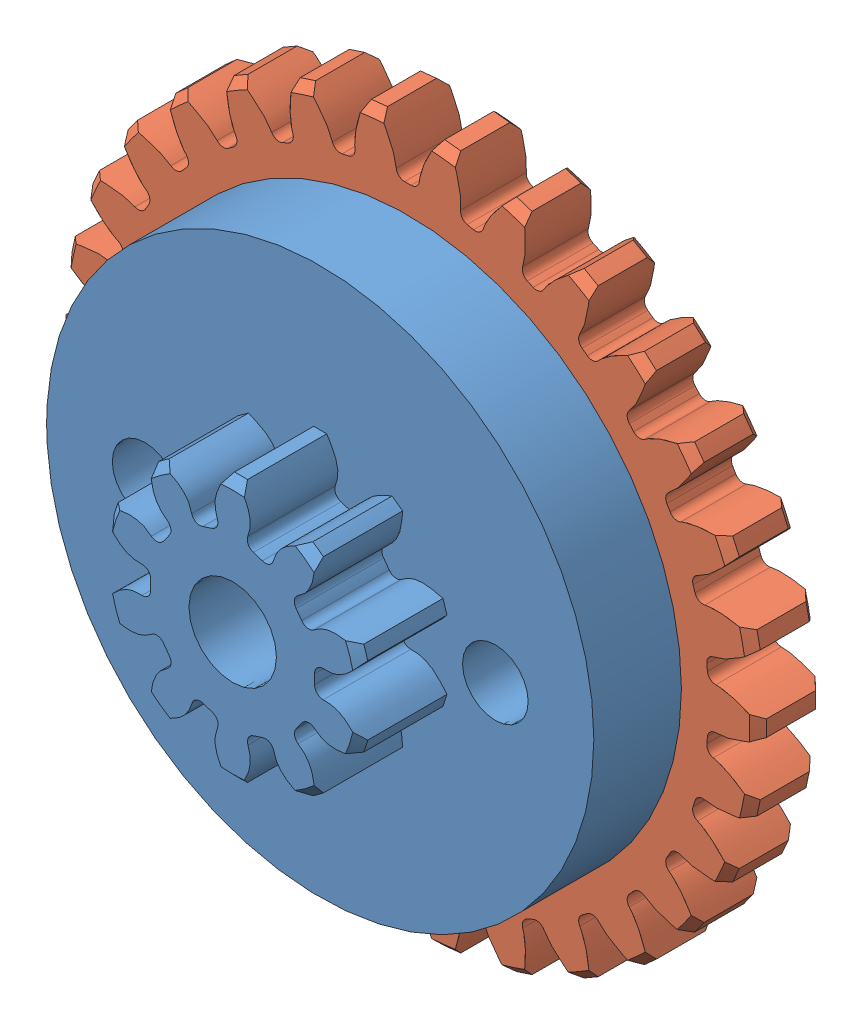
SolidWorks assembly limiteur.SLDASM, configuration Default (file format 14000). Lengths in mm.
Overall size (20.11 20.14 5.5).
2 component instances, 2 part files, 3 mates.
Components (placement in the parent):
- Roue plateau limit-1: Roue plateau limit.SLDPRT [Défaut] at (-0.7598 -0.1657 0.5135) size (12.5 12.5 4)
- Roue aval limiteur-1: Roue aval limiteur.SLDPRT [Défaut] at (-0.7598 -0.1657 -3.4865) x (-0.951057 -0.309017 0) z (0 0 1) size (15.95 16 2.75)
Mates (geometry in assembly coordinates):
- Coïncidente1: coincident anti-aligned: plane of Roue plateau limit-1 through (-0.7598 -0.1657 -3.4865) normal (0 0 -1); plane of Roue aval limiteur-1 through (-0.7598 -0.1657 -3.4865) normal (0 0 1)
- Coaxiale1: concentric aligned: cylinder of Roue plateau limit-1 through (-4.7598 -0.1657 0.5135) axis (0 0 -1) radius 0.75; cylinder of Roue aval limiteur-1 through (-4.7598 -0.1657 -2.2365) axis (0 0 -1) radius 0.75
- Coaxiale2: concentric aligned: cylinder of Roue plateau limit-1 through (3.2402 -0.1657 0.5135) axis (0 0 -1) radius 0.75; cylinder of Roue aval limiteur-1 through (3.2402 -0.1657 -2.2365) axis (0 0 -1) radius 0.75
